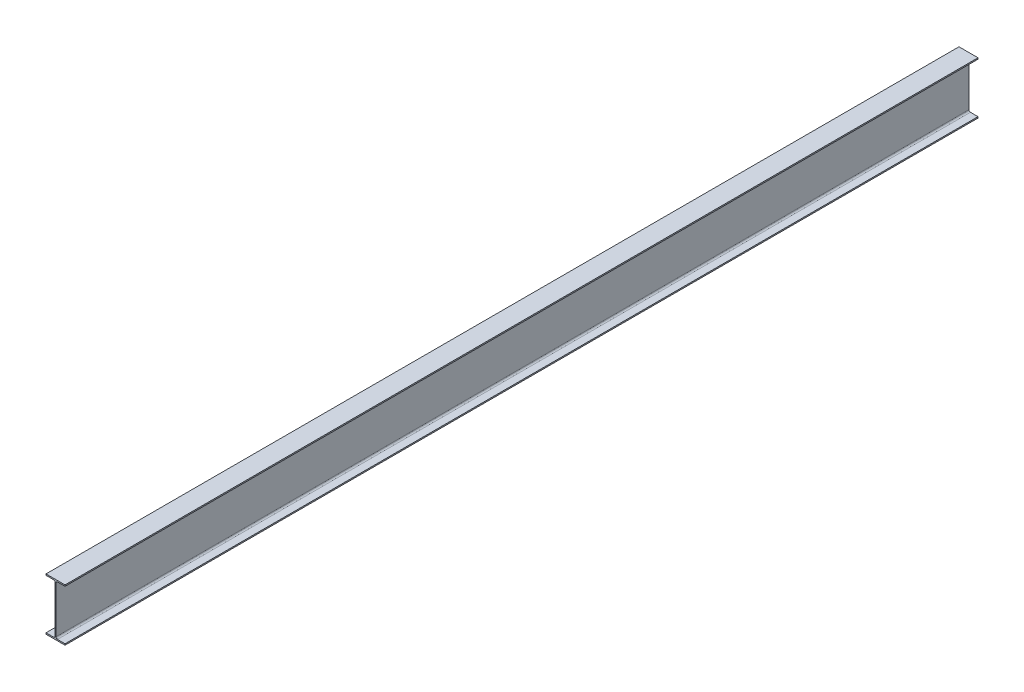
ISO-10303-21;
HEADER;
FILE_DESCRIPTION(('STEP AP214'),'2;1');
FILE_NAME('part.step','',(''),(''),'','','');
FILE_SCHEMA(('AUTOMOTIVE_DESIGN { 1 0 10303 214 1 1 1 1 }'));
ENDSEC;
DATA;
#1=APPLICATION_CONTEXT('core data for automotive mechanical design processes');
#2=APPLICATION_PROTOCOL_DEFINITION('international standard','automotive_design',2000,#1);
#3=PRODUCT_CONTEXT('',#1,'mechanical');
#4=PRODUCT('Part','Part','',(#3));
#5=PRODUCT_RELATED_PRODUCT_CATEGORY('part','',(#4));
#6=PRODUCT_DEFINITION_FORMATION('','',#4);
#7=PRODUCT_DEFINITION_CONTEXT('part definition',#1,'design');
#8=PRODUCT_DEFINITION('design','',#6,#7);
#9=PRODUCT_DEFINITION_SHAPE('','',#8);
#10=(LENGTH_UNIT() NAMED_UNIT(*) SI_UNIT(.MILLI.,.METRE.));
#11=(NAMED_UNIT(*) PLANE_ANGLE_UNIT() SI_UNIT($,.RADIAN.));
#12=(NAMED_UNIT(*) SI_UNIT($,.STERADIAN.) SOLID_ANGLE_UNIT());
#13=UNCERTAINTY_MEASURE_WITH_UNIT(LENGTH_MEASURE(1.E-05),#10,'distance_accuracy_value','');
#14=(GEOMETRIC_REPRESENTATION_CONTEXT(3) GLOBAL_UNCERTAINTY_ASSIGNED_CONTEXT((#13)) GLOBAL_UNIT_ASSIGNED_CONTEXT((#10,
#11,#12)) REPRESENTATION_CONTEXT('',''));
#15=CARTESIAN_POINT('',(0.,0.,0.));
#16=DIRECTION('',(0.,0.,1.));
#17=DIRECTION('',(1.,0.,0.));
#18=AXIS2_PLACEMENT_3D('',#15,#16,#17);
#19=CARTESIAN_POINT('',(63.4999999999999,-174.498,3048.));
#20=DIRECTION('',(0.,1.,0.));
#21=DIRECTION('',(0.,0.,1.));
#22=AXIS2_PLACEMENT_3D('',#19,#20,#21);
#23=PLANE('',#22);
#24=DIRECTION('',(1.,0.,0.));
#25=VECTOR('',#24,1.);
#26=CARTESIAN_POINT('',(63.4999999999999,-174.498,-3048.));
#27=LINE('',#26,#25);
#28=CARTESIAN_POINT('',(-63.4999999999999,-174.498,-3048.));
#29=VERTEX_POINT('',#28);
#30=CARTESIAN_POINT('',(63.4999999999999,-174.498,-3048.));
#31=VERTEX_POINT('',#30);
#32=EDGE_CURVE('E177',#29,#31,#27,.T.);
#33=ORIENTED_EDGE('',*,*,#32,.T.);
#34=DIRECTION('',(0.,0.,-1.));
#35=VECTOR('',#34,1.);
#36=CARTESIAN_POINT('',(63.4999999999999,-174.498,3048.));
#37=LINE('',#36,#35);
#38=CARTESIAN_POINT('',(63.4999999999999,-174.498,3048.));
#39=VERTEX_POINT('',#38);
#40=EDGE_CURVE('E11',#39,#31,#37,.T.);
#41=ORIENTED_EDGE('',*,*,#40,.F.);
#42=DIRECTION('',(1.,0.,0.));
#43=VECTOR('',#42,1.);
#44=CARTESIAN_POINT('',(63.4999999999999,-174.498,3048.));
#45=LINE('',#44,#43);
#46=CARTESIAN_POINT('',(-63.4999999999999,-174.498,3048.));
#47=VERTEX_POINT('',#46);
#48=EDGE_CURVE('E207',#47,#39,#45,.T.);
#49=ORIENTED_EDGE('',*,*,#48,.F.);
#50=DIRECTION('',(0.,0.,-1.));
#51=VECTOR('',#50,1.);
#52=CARTESIAN_POINT('',(-63.4999999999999,-174.498,3048.));
#53=LINE('',#52,#51);
#54=EDGE_CURVE('E173',#47,#29,#53,.T.);
#55=ORIENTED_EDGE('',*,*,#54,.T.);
#56=EDGE_LOOP('',(#33,#41,#49,#55));
#57=FACE_BOUND('',#56,.T.);
#58=ADVANCED_FACE('F33',(#57),#23,.F.);
#59=CARTESIAN_POINT('',(63.4999999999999,-165.989,3048.));
#60=DIRECTION('',(-1.,0.,0.));
#61=DIRECTION('',(0.,0.,1.));
#62=AXIS2_PLACEMENT_3D('',#59,#60,#61);
#63=PLANE('',#62);
#64=DIRECTION('',(0.,1.,0.));
#65=VECTOR('',#64,1.);
#66=CARTESIAN_POINT('',(63.4999999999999,-165.989,-3048.));
#67=LINE('',#66,#65);
#68=CARTESIAN_POINT('',(63.4999999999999,-165.989,-3048.));
#69=VERTEX_POINT('',#68);
#70=EDGE_CURVE('E180',#31,#69,#67,.T.);
#71=ORIENTED_EDGE('',*,*,#70,.T.);
#72=DIRECTION('',(0.,0.,-1.));
#73=VECTOR('',#72,1.);
#74=CARTESIAN_POINT('',(63.4999999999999,-165.989,3048.));
#75=LINE('',#74,#73);
#76=CARTESIAN_POINT('',(63.4999999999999,-165.989,3048.));
#77=VERTEX_POINT('',#76);
#78=EDGE_CURVE('E41',#77,#69,#75,.T.);
#79=ORIENTED_EDGE('',*,*,#78,.F.);
#80=DIRECTION('',(0.,1.,0.));
#81=VECTOR('',#80,1.);
#82=CARTESIAN_POINT('',(63.4999999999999,-165.989,3048.));
#83=LINE('',#82,#81);
#84=EDGE_CURVE('E116',#39,#77,#83,.T.);
#85=ORIENTED_EDGE('',*,*,#84,.F.);
#86=ORIENTED_EDGE('',*,*,#40,.T.);
#87=EDGE_LOOP('',(#71,#79,#85,#86));
#88=FACE_BOUND('',#87,.T.);
#89=ADVANCED_FACE('F305',(#88),#63,.F.);
#90=CARTESIAN_POINT('',(13.081,-165.989,3048.));
#91=DIRECTION('',(0.,-1.,0.));
#92=DIRECTION('',(1.,0.,0.));
#93=AXIS2_PLACEMENT_3D('',#90,#91,#92);
#94=PLANE('',#93);
#95=DIRECTION('',(-1.,0.,0.));
#96=VECTOR('',#95,1.);
#97=CARTESIAN_POINT('',(13.081,-165.989,-3048.));
#98=LINE('',#97,#96);
#99=CARTESIAN_POINT('',(13.081,-165.989,-3048.));
#100=VERTEX_POINT('',#99);
#101=EDGE_CURVE('E182',#69,#100,#98,.T.);
#102=ORIENTED_EDGE('',*,*,#101,.T.);
#103=DIRECTION('',(0.,0.,-1.));
#104=VECTOR('',#103,1.);
#105=CARTESIAN_POINT('',(13.081,-165.989,3048.));
#106=LINE('',#105,#104);
#107=CARTESIAN_POINT('',(13.081,-165.989,3048.));
#108=VERTEX_POINT('',#107);
#109=EDGE_CURVE('E238',#108,#100,#106,.T.);
#110=ORIENTED_EDGE('',*,*,#109,.F.);
#111=DIRECTION('',(-1.,0.,0.));
#112=VECTOR('',#111,1.);
#113=CARTESIAN_POINT('',(13.081,-165.989,3048.));
#114=LINE('',#113,#112);
#115=EDGE_CURVE('E246',#77,#108,#114,.T.);
#116=ORIENTED_EDGE('',*,*,#115,.F.);
#117=ORIENTED_EDGE('',*,*,#78,.T.);
#118=EDGE_LOOP('',(#102,#110,#116,#117));
#119=FACE_BOUND('',#118,.T.);
#120=ADVANCED_FACE('F244',(#119),#94,.F.);
#121=CARTESIAN_POINT('',(13.081,-155.829,3048.));
#122=DIRECTION('',(0.,0.,-1.));
#123=DIRECTION('',(-1.,0.,0.));
#124=AXIS2_PLACEMENT_3D('',#121,#122,#123);
#125=CYLINDRICAL_SURFACE('',#124,10.16);
#126=CARTESIAN_POINT('',(13.081,-155.829,-3048.));
#127=DIRECTION('',(0.,0.,-1.));
#128=DIRECTION('',(1.,0.,0.));
#129=AXIS2_PLACEMENT_3D('',#126,#127,#128);
#130=CIRCLE('',#129,10.16);
#131=CARTESIAN_POINT('',(2.92100000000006,-155.829,-3048.));
#132=VERTEX_POINT('',#131);
#133=EDGE_CURVE('E184',#100,#132,#130,.T.);
#134=ORIENTED_EDGE('',*,*,#133,.T.);
#135=DIRECTION('',(0.,0.,-1.));
#136=VECTOR('',#135,1.);
#137=CARTESIAN_POINT('',(2.92100000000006,-155.829,3048.));
#138=LINE('',#137,#136);
#139=CARTESIAN_POINT('',(2.92100000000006,-155.829,3048.));
#140=VERTEX_POINT('',#139);
#141=EDGE_CURVE('E235',#140,#132,#138,.T.);
#142=ORIENTED_EDGE('',*,*,#141,.F.);
#143=CARTESIAN_POINT('',(13.081,-155.829,3048.));
#144=DIRECTION('',(0.,0.,-1.));
#145=DIRECTION('',(1.,0.,0.));
#146=AXIS2_PLACEMENT_3D('',#143,#144,#145);
#147=CIRCLE('',#146,10.16);
#148=EDGE_CURVE('E264',#108,#140,#147,.T.);
#149=ORIENTED_EDGE('',*,*,#148,.F.);
#150=ORIENTED_EDGE('',*,*,#109,.T.);
#151=EDGE_LOOP('',(#134,#142,#149,#150));
#152=FACE_BOUND('',#151,.T.);
#153=ADVANCED_FACE('F255',(#152),#125,.F.);
#154=CARTESIAN_POINT('',(2.92100000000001,155.829,3048.));
#155=DIRECTION('',(-1.,0.,0.));
#156=DIRECTION('',(0.,-1.,0.));
#157=AXIS2_PLACEMENT_3D('',#154,#155,#156);
#158=PLANE('',#157);
#159=DIRECTION('',(0.,1.,0.));
#160=VECTOR('',#159,1.);
#161=CARTESIAN_POINT('',(2.92100000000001,155.829,-3048.));
#162=LINE('',#161,#160);
#163=CARTESIAN_POINT('',(2.921,155.829,-3048.));
#164=VERTEX_POINT('',#163);
#165=EDGE_CURVE('E186',#132,#164,#162,.T.);
#166=ORIENTED_EDGE('',*,*,#165,.T.);
#167=DIRECTION('',(0.,0.,-1.));
#168=VECTOR('',#167,1.);
#169=CARTESIAN_POINT('',(2.921,155.829,3048.));
#170=LINE('',#169,#168);
#171=CARTESIAN_POINT('',(2.921,155.829,3048.));
#172=VERTEX_POINT('',#171);
#173=EDGE_CURVE('E232',#172,#164,#170,.T.);
#174=ORIENTED_EDGE('',*,*,#173,.F.);
#175=DIRECTION('',(0.,1.,0.));
#176=VECTOR('',#175,1.);
#177=CARTESIAN_POINT('',(2.92100000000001,155.829,3048.));
#178=LINE('',#177,#176);
#179=EDGE_CURVE('E261',#140,#172,#178,.T.);
#180=ORIENTED_EDGE('',*,*,#179,.F.);
#181=ORIENTED_EDGE('',*,*,#141,.T.);
#182=EDGE_LOOP('',(#166,#174,#180,#181));
#183=FACE_BOUND('',#182,.T.);
#184=ADVANCED_FACE('F259',(#183),#158,.F.);
#185=CARTESIAN_POINT('',(13.081,155.829,3048.));
#186=DIRECTION('',(0.,0.,-1.));
#187=DIRECTION('',(-1.,0.,0.));
#188=AXIS2_PLACEMENT_3D('',#185,#186,#187);
#189=CYLINDRICAL_SURFACE('',#188,10.16);
#190=CARTESIAN_POINT('',(13.081,155.829,-3048.));
#191=DIRECTION('',(0.,0.,-1.));
#192=DIRECTION('',(1.,0.,0.));
#193=AXIS2_PLACEMENT_3D('',#190,#191,#192);
#194=CIRCLE('',#193,10.16);
#195=CARTESIAN_POINT('',(13.081,165.989,-3048.));
#196=VERTEX_POINT('',#195);
#197=EDGE_CURVE('E188',#164,#196,#194,.T.);
#198=ORIENTED_EDGE('',*,*,#197,.T.);
#199=DIRECTION('',(0.,0.,-1.));
#200=VECTOR('',#199,1.);
#201=CARTESIAN_POINT('',(13.081,165.989,3048.));
#202=LINE('',#201,#200);
#203=CARTESIAN_POINT('',(13.081,165.989,3048.));
#204=VERTEX_POINT('',#203);
#205=EDGE_CURVE('E229',#204,#196,#202,.T.);
#206=ORIENTED_EDGE('',*,*,#205,.F.);
#207=CARTESIAN_POINT('',(13.081,155.829,3048.));
#208=DIRECTION('',(0.,0.,-1.));
#209=DIRECTION('',(1.,0.,0.));
#210=AXIS2_PLACEMENT_3D('',#207,#208,#209);
#211=CIRCLE('',#210,10.16);
#212=EDGE_CURVE('E263',#172,#204,#211,.T.);
#213=ORIENTED_EDGE('',*,*,#212,.F.);
#214=ORIENTED_EDGE('',*,*,#173,.T.);
#215=EDGE_LOOP('',(#198,#206,#213,#214));
#216=FACE_BOUND('',#215,.T.);
#217=ADVANCED_FACE('F318',(#216),#189,.F.);
#218=CARTESIAN_POINT('',(63.5,165.989,3048.));
#219=DIRECTION('',(0.,1.,0.));
#220=DIRECTION('',(0.,0.,1.));
#221=AXIS2_PLACEMENT_3D('',#218,#219,#220);
#222=PLANE('',#221);
#223=DIRECTION('',(1.,0.,0.));
#224=VECTOR('',#223,1.);
#225=CARTESIAN_POINT('',(63.5,165.989,-3048.));
#226=LINE('',#225,#224);
#227=CARTESIAN_POINT('',(63.5,165.989,-3048.));
#228=VERTEX_POINT('',#227);
#229=EDGE_CURVE('E190',#196,#228,#226,.T.);
#230=ORIENTED_EDGE('',*,*,#229,.T.);
#231=DIRECTION('',(0.,0.,-1.));
#232=VECTOR('',#231,1.);
#233=CARTESIAN_POINT('',(63.5,165.989,3048.));
#234=LINE('',#233,#232);
#235=CARTESIAN_POINT('',(63.5,165.989,3048.));
#236=VERTEX_POINT('',#235);
#237=EDGE_CURVE('E226',#236,#228,#234,.T.);
#238=ORIENTED_EDGE('',*,*,#237,.F.);
#239=DIRECTION('',(1.,0.,0.));
#240=VECTOR('',#239,1.);
#241=CARTESIAN_POINT('',(63.5,165.989,3048.));
#242=LINE('',#241,#240);
#243=EDGE_CURVE('E266',#204,#236,#242,.T.);
#244=ORIENTED_EDGE('',*,*,#243,.F.);
#245=ORIENTED_EDGE('',*,*,#205,.T.);
#246=EDGE_LOOP('',(#230,#238,#244,#245));
#247=FACE_BOUND('',#246,.T.);
#248=ADVANCED_FACE('F321',(#247),#222,.F.);
#249=CARTESIAN_POINT('',(63.5,174.498,3048.));
#250=DIRECTION('',(-1.,0.,0.));
#251=DIRECTION('',(0.,0.,1.));
#252=AXIS2_PLACEMENT_3D('',#249,#250,#251);
#253=PLANE('',#252);
#254=DIRECTION('',(0.,1.,0.));
#255=VECTOR('',#254,1.);
#256=CARTESIAN_POINT('',(63.5,174.498,-3048.));
#257=LINE('',#256,#255);
#258=CARTESIAN_POINT('',(63.5,174.498,-3048.));
#259=VERTEX_POINT('',#258);
#260=EDGE_CURVE('E192',#228,#259,#257,.T.);
#261=ORIENTED_EDGE('',*,*,#260,.T.);
#262=DIRECTION('',(0.,0.,-1.));
#263=VECTOR('',#262,1.);
#264=CARTESIAN_POINT('',(63.5,174.498,3048.));
#265=LINE('',#264,#263);
#266=CARTESIAN_POINT('',(63.5,174.498,3048.));
#267=VERTEX_POINT('',#266);
#268=EDGE_CURVE('E223',#267,#259,#265,.T.);
#269=ORIENTED_EDGE('',*,*,#268,.F.);
#270=DIRECTION('',(0.,1.,0.));
#271=VECTOR('',#270,1.);
#272=CARTESIAN_POINT('',(63.5,174.498,3048.));
#273=LINE('',#272,#271);
#274=EDGE_CURVE('E272',#236,#267,#273,.T.);
#275=ORIENTED_EDGE('',*,*,#274,.F.);
#276=ORIENTED_EDGE('',*,*,#237,.T.);
#277=EDGE_LOOP('',(#261,#269,#275,#276));
#278=FACE_BOUND('',#277,.T.);
#279=ADVANCED_FACE('F325',(#278),#253,.F.);
#280=CARTESIAN_POINT('',(-63.5,174.498,3048.));
#281=DIRECTION('',(0.,-1.,0.));
#282=DIRECTION('',(0.,0.,-1.));
#283=AXIS2_PLACEMENT_3D('',#280,#281,#282);
#284=PLANE('',#283);
#285=DIRECTION('',(-1.,0.,0.));
#286=VECTOR('',#285,1.);
#287=CARTESIAN_POINT('',(-63.5,174.498,-3048.));
#288=LINE('',#287,#286);
#289=CARTESIAN_POINT('',(-63.5,174.498,-3048.));
#290=VERTEX_POINT('',#289);
#291=EDGE_CURVE('E194',#259,#290,#288,.T.);
#292=ORIENTED_EDGE('',*,*,#291,.T.);
#293=DIRECTION('',(0.,0.,-1.));
#294=VECTOR('',#293,1.);
#295=CARTESIAN_POINT('',(-63.5,174.498,3048.));
#296=LINE('',#295,#294);
#297=CARTESIAN_POINT('',(-63.5,174.498,3048.));
#298=VERTEX_POINT('',#297);
#299=EDGE_CURVE('E220',#298,#290,#296,.T.);
#300=ORIENTED_EDGE('',*,*,#299,.F.);
#301=DIRECTION('',(-1.,0.,0.));
#302=VECTOR('',#301,1.);
#303=CARTESIAN_POINT('',(-63.5,174.498,3048.));
#304=LINE('',#303,#302);
#305=EDGE_CURVE('E274',#267,#298,#304,.T.);
#306=ORIENTED_EDGE('',*,*,#305,.F.);
#307=ORIENTED_EDGE('',*,*,#268,.T.);
#308=EDGE_LOOP('',(#292,#300,#306,#307));
#309=FACE_BOUND('',#308,.T.);
#310=ADVANCED_FACE('F329',(#309),#284,.F.);
#311=CARTESIAN_POINT('',(-63.5,165.989,3048.));
#312=DIRECTION('',(1.,0.,0.));
#313=DIRECTION('',(0.,0.,-1.));
#314=AXIS2_PLACEMENT_3D('',#311,#312,#313);
#315=PLANE('',#314);
#316=DIRECTION('',(0.,-1.,0.));
#317=VECTOR('',#316,1.);
#318=CARTESIAN_POINT('',(-63.5,165.989,-3048.));
#319=LINE('',#318,#317);
#320=CARTESIAN_POINT('',(-63.5,165.989,-3048.));
#321=VERTEX_POINT('',#320);
#322=EDGE_CURVE('E196',#290,#321,#319,.T.);
#323=ORIENTED_EDGE('',*,*,#322,.T.);
#324=DIRECTION('',(0.,0.,-1.));
#325=VECTOR('',#324,1.);
#326=CARTESIAN_POINT('',(-63.5,165.989,3048.));
#327=LINE('',#326,#325);
#328=CARTESIAN_POINT('',(-63.5,165.989,3048.));
#329=VERTEX_POINT('',#328);
#330=EDGE_CURVE('E217',#329,#321,#327,.T.);
#331=ORIENTED_EDGE('',*,*,#330,.F.);
#332=DIRECTION('',(0.,-1.,0.));
#333=VECTOR('',#332,1.);
#334=CARTESIAN_POINT('',(-63.5,165.989,3048.));
#335=LINE('',#334,#333);
#336=EDGE_CURVE('E276',#298,#329,#335,.T.);
#337=ORIENTED_EDGE('',*,*,#336,.F.);
#338=ORIENTED_EDGE('',*,*,#299,.T.);
#339=EDGE_LOOP('',(#323,#331,#337,#338));
#340=FACE_BOUND('',#339,.T.);
#341=ADVANCED_FACE('F333',(#340),#315,.F.);
#342=CARTESIAN_POINT('',(-13.081,165.989,3048.));
#343=DIRECTION('',(0.,1.,0.));
#344=DIRECTION('',(0.,0.,1.));
#345=AXIS2_PLACEMENT_3D('',#342,#343,#344);
#346=PLANE('',#345);
#347=DIRECTION('',(1.,0.,0.));
#348=VECTOR('',#347,1.);
#349=CARTESIAN_POINT('',(-13.081,165.989,-3048.));
#350=LINE('',#349,#348);
#351=CARTESIAN_POINT('',(-13.081,165.989,-3048.));
#352=VERTEX_POINT('',#351);
#353=EDGE_CURVE('E198',#321,#352,#350,.T.);
#354=ORIENTED_EDGE('',*,*,#353,.T.);
#355=DIRECTION('',(0.,0.,-1.));
#356=VECTOR('',#355,1.);
#357=CARTESIAN_POINT('',(-13.081,165.989,3048.));
#358=LINE('',#357,#356);
#359=CARTESIAN_POINT('',(-13.081,165.989,3048.));
#360=VERTEX_POINT('',#359);
#361=EDGE_CURVE('E214',#360,#352,#358,.T.);
#362=ORIENTED_EDGE('',*,*,#361,.F.);
#363=DIRECTION('',(1.,0.,0.));
#364=VECTOR('',#363,1.);
#365=CARTESIAN_POINT('',(-13.081,165.989,3048.));
#366=LINE('',#365,#364);
#367=EDGE_CURVE('E278',#329,#360,#366,.T.);
#368=ORIENTED_EDGE('',*,*,#367,.F.);
#369=ORIENTED_EDGE('',*,*,#330,.T.);
#370=EDGE_LOOP('',(#354,#362,#368,#369));
#371=FACE_BOUND('',#370,.T.);
#372=ADVANCED_FACE('F337',(#371),#346,.F.);
#373=CARTESIAN_POINT('',(-13.081,155.829,3048.));
#374=DIRECTION('',(0.,0.,-1.));
#375=DIRECTION('',(-1.,0.,0.));
#376=AXIS2_PLACEMENT_3D('',#373,#374,#375);
#377=CYLINDRICAL_SURFACE('',#376,10.16);
#378=CARTESIAN_POINT('',(-13.081,155.829,-3048.));
#379=DIRECTION('',(0.,0.,-1.));
#380=DIRECTION('',(1.,0.,0.));
#381=AXIS2_PLACEMENT_3D('',#378,#379,#380);
#382=CIRCLE('',#381,10.16);
#383=CARTESIAN_POINT('',(-2.92100000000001,155.829,-3048.));
#384=VERTEX_POINT('',#383);
#385=EDGE_CURVE('E200',#352,#384,#382,.T.);
#386=ORIENTED_EDGE('',*,*,#385,.T.);
#387=DIRECTION('',(0.,0.,-1.));
#388=VECTOR('',#387,1.);
#389=CARTESIAN_POINT('',(-2.92100000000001,155.829,3048.));
#390=LINE('',#389,#388);
#391=CARTESIAN_POINT('',(-2.92100000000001,155.829,3048.));
#392=VERTEX_POINT('',#391);
#393=EDGE_CURVE('E211',#392,#384,#390,.T.);
#394=ORIENTED_EDGE('',*,*,#393,.F.);
#395=CARTESIAN_POINT('',(-13.081,155.829,3048.));
#396=DIRECTION('',(0.,0.,-1.));
#397=DIRECTION('',(1.,0.,0.));
#398=AXIS2_PLACEMENT_3D('',#395,#396,#397);
#399=CIRCLE('',#398,10.16);
#400=EDGE_CURVE('E280',#360,#392,#399,.T.);
#401=ORIENTED_EDGE('',*,*,#400,.F.);
#402=ORIENTED_EDGE('',*,*,#361,.T.);
#403=EDGE_LOOP('',(#386,#394,#401,#402));
#404=FACE_BOUND('',#403,.T.);
#405=ADVANCED_FACE('F286',(#404),#377,.F.);
#406=CARTESIAN_POINT('',(-2.92099999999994,-155.829,3048.));
#407=DIRECTION('',(1.,0.,0.));
#408=DIRECTION('',(0.,1.,0.));
#409=AXIS2_PLACEMENT_3D('',#406,#407,#408);
#410=PLANE('',#409);
#411=DIRECTION('',(0.,-1.,0.));
#412=VECTOR('',#411,1.);
#413=CARTESIAN_POINT('',(-2.92099999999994,-155.829,-3048.));
#414=LINE('',#413,#412);
#415=CARTESIAN_POINT('',(-2.92099999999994,-155.829,-3048.));
#416=VERTEX_POINT('',#415);
#417=EDGE_CURVE('E202',#384,#416,#414,.T.);
#418=ORIENTED_EDGE('',*,*,#417,.T.);
#419=DIRECTION('',(0.,0.,-1.));
#420=VECTOR('',#419,1.);
#421=CARTESIAN_POINT('',(-2.92099999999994,-155.829,3048.));
#422=LINE('',#421,#420);
#423=CARTESIAN_POINT('',(-2.92099999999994,-155.829,3048.));
#424=VERTEX_POINT('',#423);
#425=EDGE_CURVE('E168',#424,#416,#422,.T.);
#426=ORIENTED_EDGE('',*,*,#425,.F.);
#427=DIRECTION('',(0.,-1.,0.));
#428=VECTOR('',#427,1.);
#429=CARTESIAN_POINT('',(-2.92099999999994,-155.829,3048.));
#430=LINE('',#429,#428);
#431=EDGE_CURVE('E159',#392,#424,#430,.T.);
#432=ORIENTED_EDGE('',*,*,#431,.F.);
#433=ORIENTED_EDGE('',*,*,#393,.T.);
#434=EDGE_LOOP('',(#418,#426,#432,#433));
#435=FACE_BOUND('',#434,.T.);
#436=ADVANCED_FACE('F290',(#435),#410,.F.);
#437=CARTESIAN_POINT('',(-13.0809999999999,-155.829,3048.));
#438=DIRECTION('',(0.,0.,-1.));
#439=DIRECTION('',(-1.,0.,0.));
#440=AXIS2_PLACEMENT_3D('',#437,#438,#439);
#441=CYLINDRICAL_SURFACE('',#440,10.16);
#442=CARTESIAN_POINT('',(-13.0809999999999,-155.829,-3048.));
#443=DIRECTION('',(0.,0.,-1.));
#444=DIRECTION('',(1.,0.,0.));
#445=AXIS2_PLACEMENT_3D('',#442,#443,#444);
#446=CIRCLE('',#445,10.16);
#447=CARTESIAN_POINT('',(-13.0809999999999,-165.989,-3048.));
#448=VERTEX_POINT('',#447);
#449=EDGE_CURVE('E167',#416,#448,#446,.T.);
#450=ORIENTED_EDGE('',*,*,#449,.T.);
#451=DIRECTION('',(0.,0.,-1.));
#452=VECTOR('',#451,1.);
#453=CARTESIAN_POINT('',(-13.0809999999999,-165.989,3048.));
#454=LINE('',#453,#452);
#455=CARTESIAN_POINT('',(-13.0809999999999,-165.989,3048.));
#456=VERTEX_POINT('',#455);
#457=EDGE_CURVE('E164',#456,#448,#454,.T.);
#458=ORIENTED_EDGE('',*,*,#457,.F.);
#459=CARTESIAN_POINT('',(-13.0809999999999,-155.829,3048.));
#460=DIRECTION('',(0.,0.,-1.));
#461=DIRECTION('',(1.,0.,0.));
#462=AXIS2_PLACEMENT_3D('',#459,#460,#461);
#463=CIRCLE('',#462,10.16);
#464=EDGE_CURVE('E153',#424,#456,#463,.T.);
#465=ORIENTED_EDGE('',*,*,#464,.F.);
#466=ORIENTED_EDGE('',*,*,#425,.T.);
#467=EDGE_LOOP('',(#450,#458,#465,#466));
#468=FACE_BOUND('',#467,.T.);
#469=ADVANCED_FACE('F165',(#468),#441,.F.);
#470=CARTESIAN_POINT('',(-63.4999999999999,-165.989,3048.));
#471=DIRECTION('',(0.,-1.,0.));
#472=DIRECTION('',(0.,0.,-1.));
#473=AXIS2_PLACEMENT_3D('',#470,#471,#472);
#474=PLANE('',#473);
#475=DIRECTION('',(-1.,0.,0.));
#476=VECTOR('',#475,1.);
#477=CARTESIAN_POINT('',(-63.4999999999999,-165.989,-3048.));
#478=LINE('',#477,#476);
#479=CARTESIAN_POINT('',(-63.4999999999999,-165.989,-3048.));
#480=VERTEX_POINT('',#479);
#481=EDGE_CURVE('E102',#448,#480,#478,.T.);
#482=ORIENTED_EDGE('',*,*,#481,.T.);
#483=DIRECTION('',(0.,0.,-1.));
#484=VECTOR('',#483,1.);
#485=CARTESIAN_POINT('',(-63.4999999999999,-165.989,3048.));
#486=LINE('',#485,#484);
#487=CARTESIAN_POINT('',(-63.4999999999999,-165.989,3048.));
#488=VERTEX_POINT('',#487);
#489=EDGE_CURVE('E169',#488,#480,#486,.T.);
#490=ORIENTED_EDGE('',*,*,#489,.F.);
#491=DIRECTION('',(-1.,0.,0.));
#492=VECTOR('',#491,1.);
#493=CARTESIAN_POINT('',(-63.4999999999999,-165.989,3048.));
#494=LINE('',#493,#492);
#495=EDGE_CURVE('E157',#456,#488,#494,.T.);
#496=ORIENTED_EDGE('',*,*,#495,.F.);
#497=ORIENTED_EDGE('',*,*,#457,.T.);
#498=EDGE_LOOP('',(#482,#490,#496,#497));
#499=FACE_BOUND('',#498,.T.);
#500=ADVANCED_FACE('F171',(#499),#474,.F.);
#501=CARTESIAN_POINT('',(-63.4999999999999,-174.498,3048.));
#502=DIRECTION('',(1.,0.,0.));
#503=DIRECTION('',(0.,0.,-1.));
#504=AXIS2_PLACEMENT_3D('',#501,#502,#503);
#505=PLANE('',#504);
#506=DIRECTION('',(0.,-1.,0.));
#507=VECTOR('',#506,1.);
#508=CARTESIAN_POINT('',(-63.4999999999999,-174.498,-3048.));
#509=LINE('',#508,#507);
#510=EDGE_CURVE('E108',#480,#29,#509,.T.);
#511=ORIENTED_EDGE('',*,*,#510,.T.);
#512=ORIENTED_EDGE('',*,*,#54,.F.);
#513=DIRECTION('',(0.,-1.,0.));
#514=VECTOR('',#513,1.);
#515=CARTESIAN_POINT('',(-63.4999999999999,-174.498,3048.));
#516=LINE('',#515,#514);
#517=EDGE_CURVE('E49',#488,#47,#516,.T.);
#518=ORIENTED_EDGE('',*,*,#517,.F.);
#519=ORIENTED_EDGE('',*,*,#489,.T.);
#520=EDGE_LOOP('',(#511,#512,#518,#519));
#521=FACE_BOUND('',#520,.T.);
#522=ADVANCED_FACE('F294',(#521),#505,.F.);
#523=CARTESIAN_POINT('',(-13.0809999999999,-155.829,3048.));
#524=DIRECTION('',(0.,0.,1.));
#525=DIRECTION('',(1.,0.,0.));
#526=AXIS2_PLACEMENT_3D('',#523,#524,#525);
#527=PLANE('',#526);
#528=ORIENTED_EDGE('',*,*,#48,.T.);
#529=ORIENTED_EDGE('',*,*,#84,.T.);
#530=ORIENTED_EDGE('',*,*,#115,.T.);
#531=ORIENTED_EDGE('',*,*,#148,.T.);
#532=ORIENTED_EDGE('',*,*,#179,.T.);
#533=ORIENTED_EDGE('',*,*,#212,.T.);
#534=ORIENTED_EDGE('',*,*,#243,.T.);
#535=ORIENTED_EDGE('',*,*,#274,.T.);
#536=ORIENTED_EDGE('',*,*,#305,.T.);
#537=ORIENTED_EDGE('',*,*,#336,.T.);
#538=ORIENTED_EDGE('',*,*,#367,.T.);
#539=ORIENTED_EDGE('',*,*,#400,.T.);
#540=ORIENTED_EDGE('',*,*,#431,.T.);
#541=ORIENTED_EDGE('',*,*,#464,.T.);
#542=ORIENTED_EDGE('',*,*,#495,.T.);
#543=ORIENTED_EDGE('',*,*,#517,.T.);
#544=EDGE_LOOP('',(#528,#529,#530,#531,#532,#533,#534,#535,#536,#537,#538,#539,#540,#541,#542,#543));
#545=FACE_BOUND('',#544,.T.);
#546=ADVANCED_FACE('F155',(#545),#527,.T.);
#547=CARTESIAN_POINT('',(-13.0809999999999,-155.829,-3048.));
#548=DIRECTION('',(0.,0.,1.));
#549=DIRECTION('',(1.,0.,0.));
#550=AXIS2_PLACEMENT_3D('',#547,#548,#549);
#551=PLANE('',#550);
#552=ORIENTED_EDGE('',*,*,#32,.F.);
#553=ORIENTED_EDGE('',*,*,#510,.F.);
#554=ORIENTED_EDGE('',*,*,#481,.F.);
#555=ORIENTED_EDGE('',*,*,#449,.F.);
#556=ORIENTED_EDGE('',*,*,#417,.F.);
#557=ORIENTED_EDGE('',*,*,#385,.F.);
#558=ORIENTED_EDGE('',*,*,#353,.F.);
#559=ORIENTED_EDGE('',*,*,#322,.F.);
#560=ORIENTED_EDGE('',*,*,#291,.F.);
#561=ORIENTED_EDGE('',*,*,#260,.F.);
#562=ORIENTED_EDGE('',*,*,#229,.F.);
#563=ORIENTED_EDGE('',*,*,#197,.F.);
#564=ORIENTED_EDGE('',*,*,#165,.F.);
#565=ORIENTED_EDGE('',*,*,#133,.F.);
#566=ORIENTED_EDGE('',*,*,#101,.F.);
#567=ORIENTED_EDGE('',*,*,#70,.F.);
#568=EDGE_LOOP('',(#552,#553,#554,#555,#556,#557,#558,#559,#560,#561,#562,#563,#564,#565,#566,#567));
#569=FACE_BOUND('',#568,.T.);
#570=ADVANCED_FACE('F250',(#569),#551,.F.);
#571=CLOSED_SHELL('',(#58,#89,#120,#153,#184,#217,#248,#279,#310,#341,#372,#405,#436,#469,#500,
#522,#546,#570));
#572=MANIFOLD_SOLID_BREP('B2',#571);
#573=ADVANCED_BREP_SHAPE_REPRESENTATION('',(#18,#572),#14);
#574=SHAPE_DEFINITION_REPRESENTATION(#9,#573);
ENDSEC;
END-ISO-10303-21;
